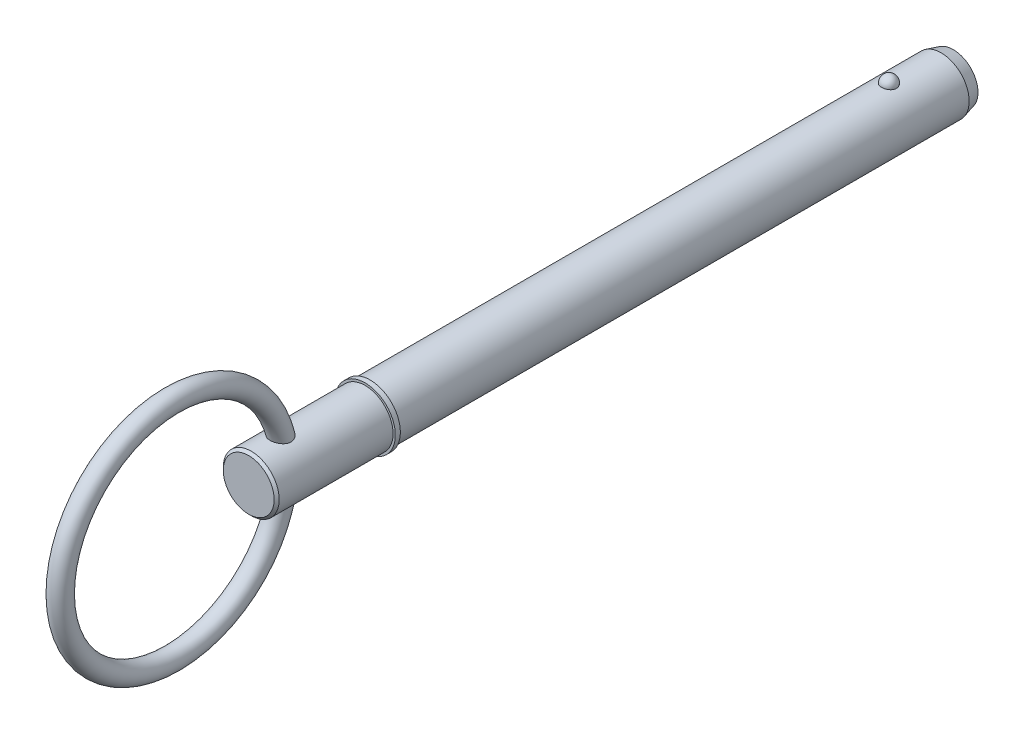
from build123d import *

# Parameters (mm, degrees)
SKETCH2_R           = 5.555
BOSS_EXTRUDE1_DEPTH = 101.6
BOSS_EXTRUDE2_START = 14.27
SKETCH3_R           = 5.555
BOSS_EXTRUDE2_DEPTH = 14.27
CHAMFER1_SIZE       = 2.4
CHAMFER1_SIZE2      = 0.643078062
SKETCH20_W          = 1
SKETCH20_H          = 6
SKETCH21_R          = 5.555
BOSS_EXTRUDE3_DEPTH = 24.13
CHAMFER2_SIZE       = 0.5
SKETCH24_R          = 2


with BuildPart() as part:
    # Sketch2 → Boss-Extrude1 (new body)
    with BuildSketch(Plane.XY):
        Circle(SKETCH2_R)
    extrude(amount=BOSS_EXTRUDE1_DEPTH)

    # Sketch3 → Boss-Extrude2 (add)
    with BuildSketch(Plane(origin=(0, 0, 0), x_dir=(-1, 0, 0), z_dir=(0, 0, -1)).offset(BOSS_EXTRUDE2_START)):
        Circle(SKETCH3_R)
    extrude(amount=-BOSS_EXTRUDE2_DEPTH)

    # Chamfer1
    chamfer1_edges = [part.edges().sort_by_distance(p)[0] for p in [
        (5.555, 0, -14.27),
    ]]
    chamfer1_side = [part.faces().sort_by_distance(p)[0] for p in [
        (5.555, 0, -7.135),
    ]]
    chamfer(chamfer1_edges, length=CHAMFER1_SIZE, length2=CHAMFER1_SIZE2, reference=chamfer1_side[0])

    # Sketch18 → Revolve1 (revolve)
    with BuildSketch(Plane(origin=(0, 0, 0), x_dir=(0, 0, -1), z_dir=(1, 0, 0))):
        with BuildLine():
            Line((1.49, 7.045), (1.49, 4.065))
            ThreePointArc((1.49, 4.065), (0, 5.555), (1.49, 7.045))
        make_face()
    revolve(axis=Axis((0, 7.045, -1.49), (0, -1, 0)))

    # Sketch20 → Revolve2 (revolve)
    with BuildSketch(Plane(origin=(0, 0, 0), x_dir=(0, 0, -1), z_dir=(1, 0, 0)), mode=Mode.PRIVATE) as revolve2_sk:
        with Locations((-102.1, 3)):
            Rectangle(SKETCH20_W, SKETCH20_H)
    revolve(revolve2_sk.sketch.rotate(Axis((0, 0, 33.728787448), (0, 0, 1)), 270), axis=Axis((0, 0, 33.728787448), (0, 0, 1)))

    # Sketch21 → Boss-Extrude3 (add)
    with BuildSketch(Plane(origin=(0, 0, 101.6), x_dir=(-1, 0, 0), z_dir=(0, 0, -1))):
        with Locations(Location((0, 0, 0), (0, 0, 180))):
            Circle(SKETCH21_R)
    extrude(amount=-BOSS_EXTRUDE3_DEPTH)

    # Chamfer2
    chamfer2_edges = [part.edges().sort_by_distance(p)[0] for p in [
        (-5.555, 0, 125.73),
    ]]
    chamfer(chamfer2_edges, length=CHAMFER2_SIZE)

    # Sweep1: sweep along a path in Sketch23
    with BuildLine(Plane(origin=(0, 0, 0), x_dir=(0, 0, -1), z_dir=(1, 0, 0))) as sweep1_path:
        CenterArc((-140.955, 0), 22.225, 0, 360)
    # Sketch24 → Sweep1 (sweep)
    with BuildSketch(Plane(origin=(0, 0, 0), x_dir=(1, 0, 0), z_dir=(0, 1, 0))):
        with Locations((0, -118.73)):
            Circle(SKETCH24_R)
    sweep(path=sweep1_path.line)


solid = part.part
